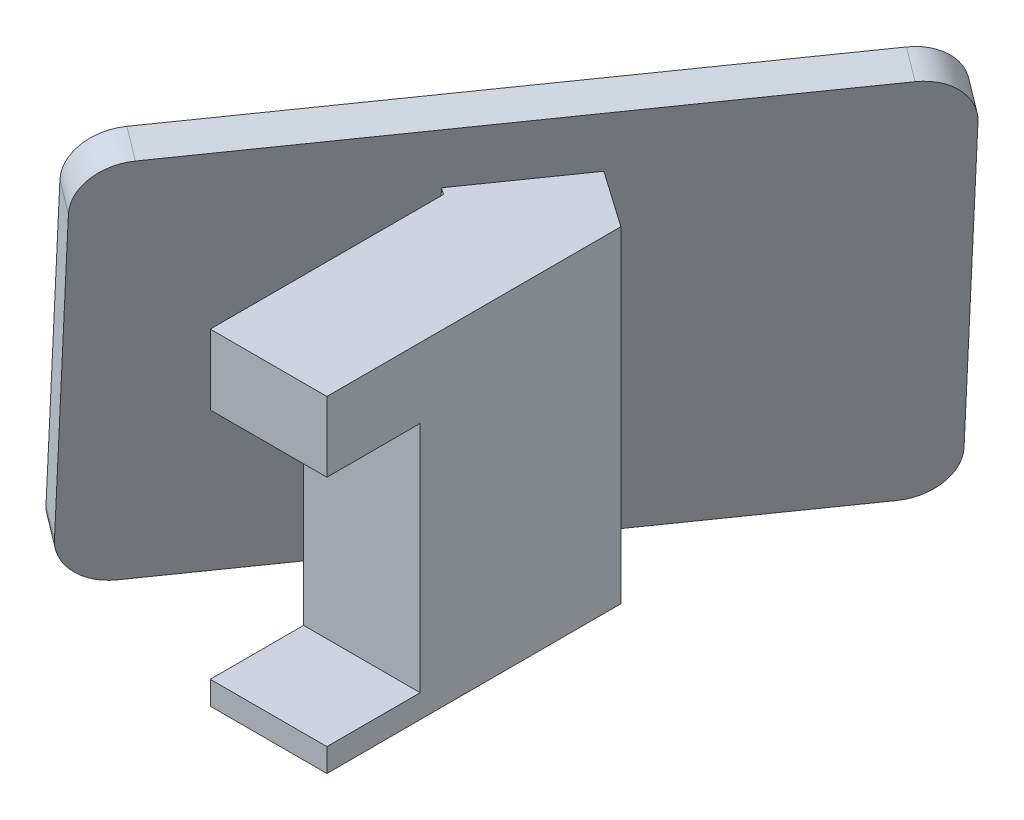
ISO-10303-21;
HEADER;
FILE_DESCRIPTION(('STEP AP214'),'2;1');
FILE_NAME('part.step','',(''),(''),'','','');
FILE_SCHEMA(('AUTOMOTIVE_DESIGN { 1 0 10303 214 1 1 1 1 }'));
ENDSEC;
DATA;
#1=APPLICATION_CONTEXT('core data for automotive mechanical design processes');
#2=APPLICATION_PROTOCOL_DEFINITION('international standard','automotive_design',2000,#1);
#3=PRODUCT_CONTEXT('',#1,'mechanical');
#4=PRODUCT('Part','Part','',(#3));
#5=PRODUCT_RELATED_PRODUCT_CATEGORY('part','',(#4));
#6=PRODUCT_DEFINITION_FORMATION('','',#4);
#7=PRODUCT_DEFINITION_CONTEXT('part definition',#1,'design');
#8=PRODUCT_DEFINITION('design','',#6,#7);
#9=PRODUCT_DEFINITION_SHAPE('','',#8);
#10=(LENGTH_UNIT() NAMED_UNIT(*) SI_UNIT(.MILLI.,.METRE.));
#11=(NAMED_UNIT(*) PLANE_ANGLE_UNIT() SI_UNIT($,.RADIAN.));
#12=(NAMED_UNIT(*) SI_UNIT($,.STERADIAN.) SOLID_ANGLE_UNIT());
#13=UNCERTAINTY_MEASURE_WITH_UNIT(LENGTH_MEASURE(1.E-05),#10,'distance_accuracy_value','');
#14=(GEOMETRIC_REPRESENTATION_CONTEXT(3) GLOBAL_UNCERTAINTY_ASSIGNED_CONTEXT((#13)) GLOBAL_UNIT_ASSIGNED_CONTEXT((#10,
#11,#12)) REPRESENTATION_CONTEXT('',''));
#15=CARTESIAN_POINT('',(0.,0.,0.));
#16=DIRECTION('',(0.,0.,1.));
#17=DIRECTION('',(1.,0.,0.));
#18=AXIS2_PLACEMENT_3D('',#15,#16,#17);
#19=CARTESIAN_POINT('',(25.,50.,0.));
#20=DIRECTION('',(0.,1.,0.));
#21=DIRECTION('',(0.,0.,1.));
#22=AXIS2_PLACEMENT_3D('',#19,#20,#21);
#23=PLANE('',#22);
#24=DIRECTION('',(0.,0.,-1.));
#25=VECTOR('',#24,1.);
#26=CARTESIAN_POINT('',(-25.,50.,0.));
#27=LINE('',#26,#25);
#28=CARTESIAN_POINT('',(-25.,50.,40.));
#29=VERTEX_POINT('',#28);
#30=CARTESIAN_POINT('',(-25.,50.,0.));
#31=VERTEX_POINT('',#30);
#32=EDGE_CURVE('E319',#29,#31,#27,.T.);
#33=ORIENTED_EDGE('',*,*,#32,.T.);
#34=DIRECTION('',(-1.,0.,0.));
#35=VECTOR('',#34,1.);
#36=CARTESIAN_POINT('',(25.,50.,0.));
#37=LINE('',#36,#35);
#38=CARTESIAN_POINT('',(25.,50.,0.));
#39=VERTEX_POINT('',#38);
#40=EDGE_CURVE('E369',#39,#31,#37,.T.);
#41=ORIENTED_EDGE('',*,*,#40,.F.);
#42=DIRECTION('',(0.,0.,-1.));
#43=VECTOR('',#42,1.);
#44=CARTESIAN_POINT('',(25.,50.,0.));
#45=LINE('',#44,#43);
#46=CARTESIAN_POINT('',(25.,50.,40.));
#47=VERTEX_POINT('',#46);
#48=EDGE_CURVE('E324',#47,#39,#45,.T.);
#49=ORIENTED_EDGE('',*,*,#48,.F.);
#50=DIRECTION('',(-1.,0.,0.));
#51=VECTOR('',#50,1.);
#52=CARTESIAN_POINT('',(25.,50.,40.));
#53=LINE('',#52,#51);
#54=EDGE_CURVE('E341',#47,#29,#53,.T.);
#55=ORIENTED_EDGE('',*,*,#54,.T.);
#56=EDGE_LOOP('',(#33,#41,#49,#55));
#57=FACE_BOUND('',#56,.T.);
#58=ADVANCED_FACE('F41',(#57),#23,.F.);
#59=CARTESIAN_POINT('',(25.,-50.,0.));
#60=DIRECTION('',(0.,0.,-1.));
#61=DIRECTION('',(-1.,0.,0.));
#62=AXIS2_PLACEMENT_3D('',#59,#60,#61);
#63=PLANE('',#62);
#64=DIRECTION('',(0.,-1.,0.));
#65=VECTOR('',#64,1.);
#66=CARTESIAN_POINT('',(-25.,-50.,0.));
#67=LINE('',#66,#65);
#68=CARTESIAN_POINT('',(-25.,-50.,0.));
#69=VERTEX_POINT('',#68);
#70=EDGE_CURVE('E344',#31,#69,#67,.T.);
#71=ORIENTED_EDGE('',*,*,#70,.T.);
#72=DIRECTION('',(-1.,0.,0.));
#73=VECTOR('',#72,1.);
#74=CARTESIAN_POINT('',(25.,-50.,0.));
#75=LINE('',#74,#73);
#76=CARTESIAN_POINT('',(25.,-50.,0.));
#77=VERTEX_POINT('',#76);
#78=EDGE_CURVE('E366',#77,#69,#75,.T.);
#79=ORIENTED_EDGE('',*,*,#78,.F.);
#80=DIRECTION('',(0.,-1.,0.));
#81=VECTOR('',#80,1.);
#82=CARTESIAN_POINT('',(25.,-50.,0.));
#83=LINE('',#82,#81);
#84=EDGE_CURVE('E327',#39,#77,#83,.T.);
#85=ORIENTED_EDGE('',*,*,#84,.F.);
#86=ORIENTED_EDGE('',*,*,#40,.T.);
#87=EDGE_LOOP('',(#71,#79,#85,#86));
#88=FACE_BOUND('',#87,.T.);
#89=ADVANCED_FACE('F459',(#88),#63,.F.);
#90=CARTESIAN_POINT('',(25.,-50.,40.));
#91=DIRECTION('',(0.,-1.,0.));
#92=DIRECTION('',(0.,0.,-1.));
#93=AXIS2_PLACEMENT_3D('',#90,#91,#92);
#94=PLANE('',#93);
#95=DIRECTION('',(0.,0.,1.));
#96=VECTOR('',#95,1.);
#97=CARTESIAN_POINT('',(-25.,-50.,40.));
#98=LINE('',#97,#96);
#99=CARTESIAN_POINT('',(-25.,-50.,40.));
#100=VERTEX_POINT('',#99);
#101=EDGE_CURVE('E346',#69,#100,#98,.T.);
#102=ORIENTED_EDGE('',*,*,#101,.T.);
#103=DIRECTION('',(-1.,0.,0.));
#104=VECTOR('',#103,1.);
#105=CARTESIAN_POINT('',(25.,-50.,40.));
#106=LINE('',#105,#104);
#107=CARTESIAN_POINT('',(25.,-50.,40.));
#108=VERTEX_POINT('',#107);
#109=EDGE_CURVE('E363',#108,#100,#106,.T.);
#110=ORIENTED_EDGE('',*,*,#109,.F.);
#111=DIRECTION('',(0.,0.,1.));
#112=VECTOR('',#111,1.);
#113=CARTESIAN_POINT('',(25.,-50.,40.));
#114=LINE('',#113,#112);
#115=EDGE_CURVE('E330',#77,#108,#114,.T.);
#116=ORIENTED_EDGE('',*,*,#115,.F.);
#117=ORIENTED_EDGE('',*,*,#78,.T.);
#118=EDGE_LOOP('',(#102,#110,#116,#117));
#119=FACE_BOUND('',#118,.T.);
#120=ADVANCED_FACE('F465',(#119),#94,.F.);
#121=CARTESIAN_POINT('',(25.,-60.,40.));
#122=DIRECTION('',(0.,0.,-1.));
#123=DIRECTION('',(0.,1.,0.));
#124=AXIS2_PLACEMENT_3D('',#121,#122,#123);
#125=PLANE('',#124);
#126=DIRECTION('',(0.,-1.,0.));
#127=VECTOR('',#126,1.);
#128=CARTESIAN_POINT('',(-25.,-60.,40.));
#129=LINE('',#128,#127);
#130=CARTESIAN_POINT('',(-25.,-60.,40.));
#131=VERTEX_POINT('',#130);
#132=EDGE_CURVE('E348',#100,#131,#129,.T.);
#133=ORIENTED_EDGE('',*,*,#132,.T.);
#134=DIRECTION('',(-1.,0.,0.));
#135=VECTOR('',#134,1.);
#136=CARTESIAN_POINT('',(25.,-60.,40.));
#137=LINE('',#136,#135);
#138=CARTESIAN_POINT('',(25.,-60.,40.));
#139=VERTEX_POINT('',#138);
#140=EDGE_CURVE('E360',#139,#131,#137,.T.);
#141=ORIENTED_EDGE('',*,*,#140,.F.);
#142=DIRECTION('',(0.,-1.,0.));
#143=VECTOR('',#142,1.);
#144=CARTESIAN_POINT('',(25.,-60.,40.));
#145=LINE('',#144,#143);
#146=EDGE_CURVE('E332',#108,#139,#145,.T.);
#147=ORIENTED_EDGE('',*,*,#146,.F.);
#148=ORIENTED_EDGE('',*,*,#109,.T.);
#149=EDGE_LOOP('',(#133,#141,#147,#148));
#150=FACE_BOUND('',#149,.T.);
#151=ADVANCED_FACE('F471',(#150),#125,.F.);
#152=CARTESIAN_POINT('',(25.,-60.,-10.));
#153=DIRECTION('',(0.,1.,0.));
#154=DIRECTION('',(0.,0.,1.));
#155=AXIS2_PLACEMENT_3D('',#152,#153,#154);
#156=PLANE('',#155);
#157=DIRECTION('',(-0.819152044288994,0.,-0.573576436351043));
#158=VECTOR('',#157,1.);
#159=CARTESIAN_POINT('',(-25.,-60.,-60.));
#160=LINE('',#159,#158);
#161=CARTESIAN_POINT('',(-25.,-60.,-60.));
#162=VERTEX_POINT('',#161);
#163=CARTESIAN_POINT('',(-48.1301752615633,-60.,-76.1959230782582));
#164=VERTEX_POINT('',#163);
#165=EDGE_CURVE('E309',#162,#164,#160,.T.);
#166=ORIENTED_EDGE('',*,*,#165,.T.);
#167=DIRECTION('',(-0.573576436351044,0.,0.819152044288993));
#168=VECTOR('',#167,1.);
#169=CARTESIAN_POINT('',(-48.1301752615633,-60.,-76.1959230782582));
#170=LINE('',#169,#168);
#171=CARTESIAN_POINT('',(-19.4513534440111,-59.9999999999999,-117.153525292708));
#172=VERTEX_POINT('',#171);
#173=EDGE_CURVE('E372',#164,#172,#170,.F.);
#174=ORIENTED_EDGE('',*,*,#173,.T.);
#175=DIRECTION('',(0.819152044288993,0.,0.573576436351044));
#176=VECTOR('',#175,1.);
#177=CARTESIAN_POINT('',(-20.8957395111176,-60.,-118.164895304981));
#178=LINE('',#177,#176);
#179=CARTESIAN_POINT('',(25.,-60.,-86.0283525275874));
#180=VERTEX_POINT('',#179);
#181=EDGE_CURVE('E298',#172,#180,#178,.T.);
#182=ORIENTED_EDGE('',*,*,#181,.T.);
#183=DIRECTION('',(0.,0.,-1.));
#184=VECTOR('',#183,1.);
#185=CARTESIAN_POINT('',(25.,-60.,-10.));
#186=LINE('',#185,#184);
#187=EDGE_CURVE('E334',#139,#180,#186,.T.);
#188=ORIENTED_EDGE('',*,*,#187,.F.);
#189=ORIENTED_EDGE('',*,*,#140,.T.);
#190=DIRECTION('',(0.,0.,-1.));
#191=VECTOR('',#190,1.);
#192=CARTESIAN_POINT('',(-25.,-60.,-10.));
#193=LINE('',#192,#191);
#194=EDGE_CURVE('E350',#131,#162,#193,.T.);
#195=ORIENTED_EDGE('',*,*,#194,.T.);
#196=EDGE_LOOP('',(#166,#174,#182,#188,#189,#195));
#197=FACE_BOUND('',#196,.T.);
#198=ADVANCED_FACE('F475',(#197),#156,.F.);
#199=CARTESIAN_POINT('',(25.,80.,40.));
#200=DIRECTION('',(0.,-1.,0.));
#201=DIRECTION('',(0.,0.,-1.));
#202=AXIS2_PLACEMENT_3D('',#199,#200,#201);
#203=PLANE('',#202);
#204=DIRECTION('',(0.819152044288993,0.,0.573576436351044));
#205=VECTOR('',#204,1.);
#206=CARTESIAN_POINT('',(-20.8957395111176,80.,-118.164895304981));
#207=LINE('',#206,#205);
#208=CARTESIAN_POINT('',(0.770051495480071,80.,-102.994345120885));
#209=VERTEX_POINT('',#208);
#210=CARTESIAN_POINT('',(25.,80.,-86.0283525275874));
#211=VERTEX_POINT('',#210);
#212=EDGE_CURVE('E316',#209,#211,#207,.T.);
#213=ORIENTED_EDGE('',*,*,#212,.F.);
#214=DIRECTION('',(-0.573576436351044,0.,0.819152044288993));
#215=VECTOR('',#214,1.);
#216=CARTESIAN_POINT('',(-58.4439049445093,80.,-18.4280512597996));
#217=LINE('',#216,#215);
#218=CARTESIAN_POINT('',(-27.9087703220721,80.,-62.0367429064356));
#219=VERTEX_POINT('',#218);
#220=EDGE_CURVE('E378',#209,#219,#217,.T.);
#221=ORIENTED_EDGE('',*,*,#220,.T.);
#222=DIRECTION('',(-0.819152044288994,0.,-0.573576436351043));
#223=VECTOR('',#222,1.);
#224=CARTESIAN_POINT('',(-25.,80.,-60.));
#225=LINE('',#224,#223);
#226=CARTESIAN_POINT('',(-25.,80.,-60.));
#227=VERTEX_POINT('',#226);
#228=EDGE_CURVE('E313',#227,#219,#225,.T.);
#229=ORIENTED_EDGE('',*,*,#228,.F.);
#230=DIRECTION('',(0.,0.,1.));
#231=VECTOR('',#230,1.);
#232=CARTESIAN_POINT('',(-25.,80.,40.));
#233=LINE('',#232,#231);
#234=CARTESIAN_POINT('',(-25.,80.,40.));
#235=VERTEX_POINT('',#234);
#236=EDGE_CURVE('E352',#227,#235,#233,.T.);
#237=ORIENTED_EDGE('',*,*,#236,.T.);
#238=DIRECTION('',(-1.,0.,0.));
#239=VECTOR('',#238,1.);
#240=CARTESIAN_POINT('',(25.,80.,40.));
#241=LINE('',#240,#239);
#242=CARTESIAN_POINT('',(25.,80.,40.));
#243=VERTEX_POINT('',#242);
#244=EDGE_CURVE('E357',#243,#235,#241,.T.);
#245=ORIENTED_EDGE('',*,*,#244,.F.);
#246=DIRECTION('',(0.,0.,1.));
#247=VECTOR('',#246,1.);
#248=CARTESIAN_POINT('',(25.,80.,40.));
#249=LINE('',#248,#247);
#250=EDGE_CURVE('E337',#211,#243,#249,.T.);
#251=ORIENTED_EDGE('',*,*,#250,.F.);
#252=EDGE_LOOP('',(#213,#221,#229,#237,#245,#251));
#253=FACE_BOUND('',#252,.T.);
#254=ADVANCED_FACE('F479',(#253),#203,.F.);
#255=CARTESIAN_POINT('',(25.,50.,40.));
#256=DIRECTION('',(0.,0.,-1.));
#257=DIRECTION('',(0.,1.,0.));
#258=AXIS2_PLACEMENT_3D('',#255,#256,#257);
#259=PLANE('',#258);
#260=DIRECTION('',(0.,-1.,0.));
#261=VECTOR('',#260,1.);
#262=CARTESIAN_POINT('',(-25.,50.,40.));
#263=LINE('',#262,#261);
#264=EDGE_CURVE('E328',#235,#29,#263,.T.);
#265=ORIENTED_EDGE('',*,*,#264,.T.);
#266=ORIENTED_EDGE('',*,*,#54,.F.);
#267=DIRECTION('',(0.,-1.,0.));
#268=VECTOR('',#267,1.);
#269=CARTESIAN_POINT('',(25.,50.,40.));
#270=LINE('',#269,#268);
#271=EDGE_CURVE('E339',#243,#47,#270,.T.);
#272=ORIENTED_EDGE('',*,*,#271,.F.);
#273=ORIENTED_EDGE('',*,*,#244,.T.);
#274=EDGE_LOOP('',(#265,#266,#272,#273));
#275=FACE_BOUND('',#274,.T.);
#276=ADVANCED_FACE('F483',(#275),#259,.F.);
#277=CARTESIAN_POINT('',(25.,0.,0.));
#278=DIRECTION('',(-1.,0.,0.));
#279=DIRECTION('',(0.,0.,1.));
#280=AXIS2_PLACEMENT_3D('',#277,#278,#279);
#281=PLANE('',#280);
#282=ORIENTED_EDGE('',*,*,#48,.T.);
#283=ORIENTED_EDGE('',*,*,#84,.T.);
#284=ORIENTED_EDGE('',*,*,#115,.T.);
#285=ORIENTED_EDGE('',*,*,#146,.T.);
#286=ORIENTED_EDGE('',*,*,#187,.T.);
#287=DIRECTION('',(0.,-1.,0.));
#288=VECTOR('',#287,1.);
#289=CARTESIAN_POINT('',(25.,211.381162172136,-86.0283525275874));
#290=LINE('',#289,#288);
#291=EDGE_CURVE('E317',#211,#180,#290,.T.);
#292=ORIENTED_EDGE('',*,*,#291,.F.);
#293=ORIENTED_EDGE('',*,*,#250,.T.);
#294=ORIENTED_EDGE('',*,*,#271,.T.);
#295=EDGE_LOOP('',(#282,#283,#284,#285,#286,#292,#293,#294));
#296=FACE_BOUND('',#295,.T.);
#297=ADVANCED_FACE('F487',(#296),#281,.F.);
#298=CARTESIAN_POINT('',(-25.,0.,0.));
#299=DIRECTION('',(-1.,0.,0.));
#300=DIRECTION('',(0.,0.,1.));
#301=AXIS2_PLACEMENT_3D('',#298,#299,#300);
#302=PLANE('',#301);
#303=ORIENTED_EDGE('',*,*,#32,.F.);
#304=ORIENTED_EDGE('',*,*,#264,.F.);
#305=ORIENTED_EDGE('',*,*,#236,.F.);
#306=DIRECTION('',(0.,-1.,0.));
#307=VECTOR('',#306,1.);
#308=CARTESIAN_POINT('',(-25.,211.381162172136,-60.));
#309=LINE('',#308,#307);
#310=EDGE_CURVE('E312',#227,#162,#309,.T.);
#311=ORIENTED_EDGE('',*,*,#310,.T.);
#312=ORIENTED_EDGE('',*,*,#194,.F.);
#313=ORIENTED_EDGE('',*,*,#132,.F.);
#314=ORIENTED_EDGE('',*,*,#101,.F.);
#315=ORIENTED_EDGE('',*,*,#70,.F.);
#316=EDGE_LOOP('',(#303,#304,#305,#311,#312,#313,#314,#315));
#317=FACE_BOUND('',#316,.T.);
#318=ADVANCED_FACE('F489',(#317),#302,.T.);
#319=CARTESIAN_POINT('',(-25.,211.381162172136,-60.));
#320=DIRECTION('',(0.573576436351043,0.,-0.819152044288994));
#321=DIRECTION('',(-0.819152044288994,0.,-0.573576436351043));
#322=AXIS2_PLACEMENT_3D('',#319,#320,#321);
#323=PLANE('',#322);
#324=ORIENTED_EDGE('',*,*,#228,.T.);
#325=DIRECTION('',(0.14224425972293,0.984807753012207,0.0996005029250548));
#326=VECTOR('',#325,1.);
#327=CARTESIAN_POINT('',(-49.5745613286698,-70.0000000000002,-77.2072930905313));
#328=LINE('',#327,#326);
#329=EDGE_CURVE('E381',#219,#164,#328,.F.);
#330=ORIENTED_EDGE('',*,*,#329,.T.);
#331=ORIENTED_EDGE('',*,*,#165,.F.);
#332=ORIENTED_EDGE('',*,*,#310,.F.);
#333=EDGE_LOOP('',(#324,#330,#331,#332));
#334=FACE_BOUND('',#333,.T.);
#335=ADVANCED_FACE('F492',(#334),#323,.F.);
#336=CARTESIAN_POINT('',(-20.8957395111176,211.381162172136,-118.164895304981));
#337=DIRECTION('',(-0.573576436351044,0.,0.819152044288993));
#338=DIRECTION('',(0.819152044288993,0.,0.573576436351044));
#339=AXIS2_PLACEMENT_3D('',#336,#337,#338);
#340=PLANE('',#339);
#341=ORIENTED_EDGE('',*,*,#181,.F.);
#342=DIRECTION('',(-0.14224425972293,-0.984807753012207,-0.099600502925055));
#343=VECTOR('',#342,1.);
#344=CARTESIAN_POINT('',(-20.8957395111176,-70.0000000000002,-118.164895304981));
#345=LINE('',#344,#343);
#346=EDGE_CURVE('E375',#172,#209,#345,.F.);
#347=ORIENTED_EDGE('',*,*,#346,.T.);
#348=ORIENTED_EDGE('',*,*,#212,.T.);
#349=ORIENTED_EDGE('',*,*,#291,.T.);
#350=EDGE_LOOP('',(#341,#347,#348,#349));
#351=FACE_BOUND('',#350,.T.);
#352=ADVANCED_FACE('F497',(#351),#340,.F.);
#353=CARTESIAN_POINT('',(-57.6378588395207,12.406865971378,-40.3584632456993));
#354=DIRECTION('',(0.806707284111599,-0.173648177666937,0.564862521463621));
#355=DIRECTION('',(0.573576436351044,0.,-0.819152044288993));
#356=AXIS2_PLACEMENT_3D('',#353,#354,#355);
#357=PLANE('',#356);
#358=DIRECTION('',(-0.573576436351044,0.,0.819152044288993));
#359=VECTOR('',#358,1.);
#360=CARTESIAN_POINT('',(44.683481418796,-72.6452017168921,-212.634908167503));
#361=LINE('',#360,#359);
#362=CARTESIAN_POINT('',(33.2119526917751,-72.6452017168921,-196.251867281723));
#363=VERTEX_POINT('',#362);
#364=CARTESIAN_POINT('',(-104.446392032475,-72.6452017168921,0.344623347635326));
#365=VERTEX_POINT('',#364);
#366=EDGE_CURVE('E290',#363,#365,#361,.T.);
#367=ORIENTED_EDGE('',*,*,#366,.F.);
#368=CARTESIAN_POINT('',(36.0568378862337,-52.949046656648,-194.259857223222));
#369=DIRECTION('',(0.806707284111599,-0.173648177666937,0.564862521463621));
#370=DIRECTION('',(0.573576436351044,0.,-0.819152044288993));
#371=AXIS2_PLACEMENT_3D('',#368,#369,#370);
#372=CIRCLE('',#371,20.);
#373=CARTESIAN_POINT('',(47.5283666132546,-52.949046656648,-210.642898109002));
#374=VERTEX_POINT('',#373);
#375=EDGE_CURVE('E395',#363,#374,#372,.T.);
#376=ORIENTED_EDGE('',*,*,#375,.T.);
#377=DIRECTION('',(-0.14224425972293,-0.984807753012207,-0.099600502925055));
#378=VECTOR('',#377,1.);
#379=CARTESIAN_POINT('',(44.683481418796,-72.6452017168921,-212.634908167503));
#380=LINE('',#379,#378);
#381=CARTESIAN_POINT('',(67.4425629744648,84.924038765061,-196.698827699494));
#382=VERTEX_POINT('',#381);
#383=EDGE_CURVE('E303',#382,#374,#380,.T.);
#384=ORIENTED_EDGE('',*,*,#383,.F.);
#385=CARTESIAN_POINT('',(55.9710342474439,84.924038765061,-180.315786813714));
#386=DIRECTION('',(0.806707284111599,-0.173648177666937,0.564862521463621));
#387=DIRECTION('',(0.573576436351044,0.,-0.819152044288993));
#388=AXIS2_PLACEMENT_3D('',#385,#386,#387);
#389=CIRCLE('',#388,20.);
#390=CARTESIAN_POINT('',(58.8159194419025,104.620193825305,-178.323776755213));
#391=VERTEX_POINT('',#390);
#392=EDGE_CURVE('E389',#382,#391,#389,.T.);
#393=ORIENTED_EDGE('',*,*,#392,.T.);
#394=DIRECTION('',(0.573576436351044,0.,-0.819152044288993));
#395=VECTOR('',#394,1.);
#396=CARTESIAN_POINT('',(70.2874481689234,104.620193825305,-194.706817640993));
#397=LINE('',#396,#395);
#398=CARTESIAN_POINT('',(-78.8424252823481,104.620193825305,18.2727138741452));
#399=VERTEX_POINT('',#398);
#400=EDGE_CURVE('E301',#399,#391,#397,.T.);
#401=ORIENTED_EDGE('',*,*,#400,.F.);
#402=CARTESIAN_POINT('',(-81.6873104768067,84.924038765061,16.2807038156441));
#403=DIRECTION('',(0.806707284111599,-0.173648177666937,0.564862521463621));
#404=DIRECTION('',(0.573576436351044,0.,-0.819152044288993));
#405=AXIS2_PLACEMENT_3D('',#402,#403,#404);
#406=CIRCLE('',#405,20.);
#407=CARTESIAN_POINT('',(-93.1588392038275,84.924038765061,32.6637447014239));
#408=VERTEX_POINT('',#407);
#409=EDGE_CURVE('E391',#399,#408,#406,.T.);
#410=ORIENTED_EDGE('',*,*,#409,.T.);
#411=DIRECTION('',(0.14224425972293,0.984807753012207,0.099600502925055));
#412=VECTOR('',#411,1.);
#413=CARTESIAN_POINT('',(-115.917920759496,-72.6452017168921,16.7276642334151));
#414=LINE('',#413,#412);
#415=CARTESIAN_POINT('',(-113.073035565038,-52.9490466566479,18.7196742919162));
#416=VERTEX_POINT('',#415);
#417=EDGE_CURVE('E274',#416,#408,#414,.T.);
#418=ORIENTED_EDGE('',*,*,#417,.F.);
#419=CARTESIAN_POINT('',(-101.601506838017,-52.9490466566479,2.33663340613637));
#420=DIRECTION('',(0.806707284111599,-0.173648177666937,0.564862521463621));
#421=DIRECTION('',(0.573576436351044,0.,-0.819152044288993));
#422=AXIS2_PLACEMENT_3D('',#419,#420,#421);
#423=CIRCLE('',#422,20.);
#424=EDGE_CURVE('E393',#416,#365,#423,.T.);
#425=ORIENTED_EDGE('',*,*,#424,.T.);
#426=EDGE_LOOP('',(#367,#376,#384,#393,#401,#410,#418,#425));
#427=FACE_BOUND('',#426,.T.);
#428=ORIENTED_EDGE('',*,*,#329,.F.);
#429=ORIENTED_EDGE('',*,*,#220,.F.);
#430=ORIENTED_EDGE('',*,*,#346,.F.);
#431=ORIENTED_EDGE('',*,*,#173,.F.);
#432=EDGE_LOOP('',(#428,#429,#430,#431));
#433=FACE_BOUND('',#432,.T.);
#434=ADVANCED_FACE('F424',(#427,#433),#357,.T.);
#435=CARTESIAN_POINT('',(-128.01853002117,-70.040479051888,8.25472641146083));
#436=DIRECTION('',(0.573576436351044,0.,-0.819152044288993));
#437=DIRECTION('',(-0.819152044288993,0.,-0.573576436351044));
#438=AXIS2_PLACEMENT_3D('',#435,#436,#437);
#439=PLANE('',#438);
#440=DIRECTION('',(0.14224425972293,0.984807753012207,0.099600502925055));
#441=VECTOR('',#440,1.);
#442=CARTESIAN_POINT('',(-128.01853002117,-70.040479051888,8.25472641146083));
#443=LINE('',#442,#441);
#444=CARTESIAN_POINT('',(-125.173644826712,-50.3443239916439,10.2467364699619));
#445=VERTEX_POINT('',#444);
#446=CARTESIAN_POINT('',(-105.259448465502,87.528761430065,24.1908068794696));
#447=VERTEX_POINT('',#446);
#448=EDGE_CURVE('E286',#445,#447,#443,.T.);
#449=ORIENTED_EDGE('',*,*,#448,.F.);
#450=DIRECTION('',(0.806707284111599,-0.173648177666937,0.564862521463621));
#451=VECTOR('',#450,1.);
#452=CARTESIAN_POINT('',(-125.173644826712,-50.3443239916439,10.2467364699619));
#453=LINE('',#452,#451);
#454=EDGE_CURVE('E412',#445,#416,#453,.T.);
#455=ORIENTED_EDGE('',*,*,#454,.T.);
#456=ORIENTED_EDGE('',*,*,#417,.T.);
#457=DIRECTION('',(0.806707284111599,-0.173648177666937,0.564862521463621));
#458=VECTOR('',#457,1.);
#459=CARTESIAN_POINT('',(-105.259448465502,87.5287614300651,24.1908068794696));
#460=LINE('',#459,#458);
#461=EDGE_CURVE('E410',#408,#447,#460,.F.);
#462=ORIENTED_EDGE('',*,*,#461,.T.);
#463=EDGE_LOOP('',(#449,#455,#456,#462));
#464=FACE_BOUND('',#463,.T.);
#465=ADVANCED_FACE('F418',(#464),#439,.F.);
#466=CARTESIAN_POINT('',(58.1868389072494,107.224916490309,-203.179755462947));
#467=DIRECTION('',(-0.14224425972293,-0.984807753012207,-0.0996005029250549));
#468=DIRECTION('',(0.989729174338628,-0.142955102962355,0.));
#469=AXIS2_PLACEMENT_3D('',#466,#467,#468);
#470=PLANE('',#469);
#471=DIRECTION('',(0.573576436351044,0.,-0.819152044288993));
#472=VECTOR('',#471,1.);
#473=CARTESIAN_POINT('',(58.1868389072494,107.224916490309,-203.179755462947));
#474=LINE('',#473,#472);
#475=CARTESIAN_POINT('',(-90.9430345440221,107.224916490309,9.7997760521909));
#476=VERTEX_POINT('',#475);
#477=CARTESIAN_POINT('',(46.7153101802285,107.224916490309,-186.796714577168));
#478=VERTEX_POINT('',#477);
#479=EDGE_CURVE('E289',#476,#478,#474,.T.);
#480=ORIENTED_EDGE('',*,*,#479,.F.);
#481=DIRECTION('',(0.806707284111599,-0.173648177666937,0.564862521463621));
#482=VECTOR('',#481,1.);
#483=CARTESIAN_POINT('',(-90.9430345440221,107.224916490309,9.79977605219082));
#484=LINE('',#483,#482);
#485=EDGE_CURVE('E11',#476,#399,#484,.T.);
#486=ORIENTED_EDGE('',*,*,#485,.T.);
#487=ORIENTED_EDGE('',*,*,#400,.T.);
#488=DIRECTION('',(0.806707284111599,-0.173648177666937,0.564862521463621));
#489=VECTOR('',#488,1.);
#490=CARTESIAN_POINT('',(46.7153101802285,107.224916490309,-186.796714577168));
#491=LINE('',#490,#489);
#492=EDGE_CURVE('E49',#391,#478,#491,.F.);
#493=ORIENTED_EDGE('',*,*,#492,.T.);
#494=EDGE_LOOP('',(#480,#486,#487,#493));
#495=FACE_BOUND('',#494,.T.);
#496=ADVANCED_FACE('F431',(#495),#470,.F.);
#497=CARTESIAN_POINT('',(32.582872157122,-70.040479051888,-221.107845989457));
#498=DIRECTION('',(-0.573576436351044,0.,0.819152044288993));
#499=DIRECTION('',(0.819152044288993,0.,0.573576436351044));
#500=AXIS2_PLACEMENT_3D('',#497,#498,#499);
#501=PLANE('',#500);
#502=ORIENTED_EDGE('',*,*,#383,.T.);
#503=DIRECTION('',(0.806707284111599,-0.173648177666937,0.564862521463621));
#504=VECTOR('',#503,1.);
#505=CARTESIAN_POINT('',(35.4277573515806,-50.3443239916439,-219.115835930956));
#506=LINE('',#505,#504);
#507=CARTESIAN_POINT('',(35.4277573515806,-50.3443239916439,-219.115835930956));
#508=VERTEX_POINT('',#507);
#509=EDGE_CURVE('E400',#374,#508,#506,.F.);
#510=ORIENTED_EDGE('',*,*,#509,.T.);
#511=DIRECTION('',(-0.14224425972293,-0.984807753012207,-0.099600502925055));
#512=VECTOR('',#511,1.);
#513=CARTESIAN_POINT('',(32.582872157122,-70.040479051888,-221.107845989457));
#514=LINE('',#513,#512);
#515=CARTESIAN_POINT('',(55.3419537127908,87.5287614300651,-205.171765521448));
#516=VERTEX_POINT('',#515);
#517=EDGE_CURVE('E292',#516,#508,#514,.T.);
#518=ORIENTED_EDGE('',*,*,#517,.F.);
#519=DIRECTION('',(0.806707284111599,-0.173648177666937,0.564862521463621));
#520=VECTOR('',#519,1.);
#521=CARTESIAN_POINT('',(55.3419537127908,87.5287614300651,-205.171765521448));
#522=LINE('',#521,#520);
#523=EDGE_CURVE('E397',#516,#382,#522,.T.);
#524=ORIENTED_EDGE('',*,*,#523,.T.);
#525=EDGE_LOOP('',(#502,#510,#518,#524));
#526=FACE_BOUND('',#525,.T.);
#527=ADVANCED_FACE('F440',(#526),#501,.F.);
#528=CARTESIAN_POINT('',(32.582872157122,-70.040479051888,-221.107845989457));
#529=DIRECTION('',(0.14224425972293,0.984807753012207,0.0996005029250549));
#530=DIRECTION('',(-0.989729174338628,0.142955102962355,0.));
#531=AXIS2_PLACEMENT_3D('',#528,#529,#530);
#532=PLANE('',#531);
#533=DIRECTION('',(-0.573576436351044,0.,0.819152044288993));
#534=VECTOR('',#533,1.);
#535=CARTESIAN_POINT('',(32.582872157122,-70.040479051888,-221.107845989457));
#536=LINE('',#535,#534);
#537=CARTESIAN_POINT('',(21.1113434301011,-70.040479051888,-204.724805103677));
#538=VERTEX_POINT('',#537);
#539=CARTESIAN_POINT('',(-116.547001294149,-70.040479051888,-8.128314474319));
#540=VERTEX_POINT('',#539);
#541=EDGE_CURVE('E295',#538,#540,#536,.T.);
#542=ORIENTED_EDGE('',*,*,#541,.F.);
#543=DIRECTION('',(0.806707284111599,-0.173648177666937,0.564862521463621));
#544=VECTOR('',#543,1.);
#545=CARTESIAN_POINT('',(21.1113434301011,-70.040479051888,-204.724805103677));
#546=LINE('',#545,#544);
#547=EDGE_CURVE('E386',#538,#363,#546,.T.);
#548=ORIENTED_EDGE('',*,*,#547,.T.);
#549=ORIENTED_EDGE('',*,*,#366,.T.);
#550=DIRECTION('',(0.806707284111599,-0.173648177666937,0.564862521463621));
#551=VECTOR('',#550,1.);
#552=CARTESIAN_POINT('',(-116.547001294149,-70.040479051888,-8.12831447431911));
#553=LINE('',#552,#551);
#554=EDGE_CURVE('E384',#365,#540,#553,.F.);
#555=ORIENTED_EDGE('',*,*,#554,.T.);
#556=EDGE_LOOP('',(#542,#548,#549,#555));
#557=FACE_BOUND('',#556,.T.);
#558=ADVANCED_FACE('F448',(#557),#532,.F.);
#559=CARTESIAN_POINT('',(-69.7384681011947,15.011588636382,-48.8314010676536));
#560=DIRECTION('',(0.806707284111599,-0.173648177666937,0.564862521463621));
#561=DIRECTION('',(0.573576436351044,0.,-0.819152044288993));
#562=AXIS2_PLACEMENT_3D('',#559,#560,#561);
#563=PLANE('',#562);
#564=DIRECTION('',(-0.14224425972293,-0.984807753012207,-0.0996005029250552));
#565=VECTOR('',#564,1.);
#566=CARTESIAN_POINT('',(52.4740715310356,87.5287614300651,-201.076005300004));
#567=LINE('',#566,#565);
#568=CARTESIAN_POINT('',(52.4740715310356,87.5287614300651,-201.076005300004));
#569=VERTEX_POINT('',#568);
#570=CARTESIAN_POINT('',(32.5598751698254,-50.3443239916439,-215.020075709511));
#571=VERTEX_POINT('',#570);
#572=EDGE_CURVE('E256',#569,#571,#567,.T.);
#573=ORIENTED_EDGE('',*,*,#572,.F.);
#574=CARTESIAN_POINT('',(43.87042498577,87.5287614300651,-188.788724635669));
#575=DIRECTION('',(-0.806707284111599,0.173648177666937,-0.564862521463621));
#576=DIRECTION('',(-0.573576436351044,0.,0.819152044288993));
#577=AXIS2_PLACEMENT_3D('',#574,#575,#576);
#578=CIRCLE('',#577,15.);
#579=CARTESIAN_POINT('',(46.0040888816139,102.300877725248,-187.294717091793));
#580=VERTEX_POINT('',#579);
#581=EDGE_CURVE('E56',#580,#569,#578,.T.);
#582=ORIENTED_EDGE('',*,*,#581,.F.);
#583=DIRECTION('',(0.573576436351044,0.,-0.819152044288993));
#584=VECTOR('',#583,1.);
#585=CARTESIAN_POINT('',(-91.6542558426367,102.300877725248,9.30177353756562));
#586=LINE('',#585,#584);
#587=CARTESIAN_POINT('',(-91.6542558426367,102.300877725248,9.30177353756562));
#588=VERTEX_POINT('',#587);
#589=EDGE_CURVE('E236',#588,#580,#586,.T.);
#590=ORIENTED_EDGE('',*,*,#589,.F.);
#591=CARTESIAN_POINT('',(-93.7879197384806,87.528761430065,7.80776599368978));
#592=DIRECTION('',(-0.806707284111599,0.173648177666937,-0.564862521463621));
#593=DIRECTION('',(-0.573576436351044,0.,0.819152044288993));
#594=AXIS2_PLACEMENT_3D('',#591,#592,#593);
#595=CIRCLE('',#594,15.);
#596=CARTESIAN_POINT('',(-102.391566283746,87.528761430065,20.0950466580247));
#597=VERTEX_POINT('',#596);
#598=EDGE_CURVE('E239',#597,#588,#595,.T.);
#599=ORIENTED_EDGE('',*,*,#598,.F.);
#600=DIRECTION('',(0.14224425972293,0.984807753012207,0.0996005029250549));
#601=VECTOR('',#600,1.);
#602=CARTESIAN_POINT('',(-122.305762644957,-50.3443239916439,6.15097624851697));
#603=LINE('',#602,#601);
#604=CARTESIAN_POINT('',(-122.305762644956,-50.3443239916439,6.15097624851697));
#605=VERTEX_POINT('',#604);
#606=EDGE_CURVE('E267',#605,#597,#603,.T.);
#607=ORIENTED_EDGE('',*,*,#606,.F.);
#608=CARTESIAN_POINT('',(-113.702116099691,-50.3443239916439,-6.13630441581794));
#609=DIRECTION('',(-0.806707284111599,0.173648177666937,-0.564862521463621));
#610=DIRECTION('',(-0.573576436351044,0.,0.819152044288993));
#611=AXIS2_PLACEMENT_3D('',#608,#609,#610);
#612=CIRCLE('',#611,15.);
#613=CARTESIAN_POINT('',(-115.835779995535,-65.116440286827,-7.63031195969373));
#614=VERTEX_POINT('',#613);
#615=EDGE_CURVE('E264',#614,#605,#612,.T.);
#616=ORIENTED_EDGE('',*,*,#615,.F.);
#617=DIRECTION('',(-0.573576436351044,0.,0.819152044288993));
#618=VECTOR('',#617,1.);
#619=CARTESIAN_POINT('',(21.8225647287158,-65.116440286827,-204.226802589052));
#620=LINE('',#619,#618);
#621=CARTESIAN_POINT('',(21.8225647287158,-65.116440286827,-204.226802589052));
#622=VERTEX_POINT('',#621);
#623=EDGE_CURVE('E261',#622,#614,#620,.T.);
#624=ORIENTED_EDGE('',*,*,#623,.F.);
#625=CARTESIAN_POINT('',(23.9562286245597,-50.3443239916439,-202.732795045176));
#626=DIRECTION('',(-0.806707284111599,0.173648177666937,-0.564862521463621));
#627=DIRECTION('',(-0.573576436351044,0.,0.819152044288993));
#628=AXIS2_PLACEMENT_3D('',#625,#626,#627);
#629=CIRCLE('',#628,15.);
#630=EDGE_CURVE('E258',#571,#622,#629,.T.);
#631=ORIENTED_EDGE('',*,*,#630,.F.);
#632=EDGE_LOOP('',(#573,#582,#590,#599,#607,#616,#624,#631));
#633=FACE_BOUND('',#632,.T.);
#634=ORIENTED_EDGE('',*,*,#517,.T.);
#635=CARTESIAN_POINT('',(23.9562286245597,-50.3443239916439,-202.732795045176));
#636=DIRECTION('',(0.806707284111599,-0.173648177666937,0.564862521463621));
#637=DIRECTION('',(0.573576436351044,0.,-0.819152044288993));
#638=AXIS2_PLACEMENT_3D('',#635,#636,#637);
#639=CIRCLE('',#638,20.);
#640=EDGE_CURVE('E408',#508,#538,#639,.F.);
#641=ORIENTED_EDGE('',*,*,#640,.T.);
#642=ORIENTED_EDGE('',*,*,#541,.T.);
#643=CARTESIAN_POINT('',(-113.702116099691,-50.3443239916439,-6.13630441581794));
#644=DIRECTION('',(0.806707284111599,-0.173648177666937,0.564862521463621));
#645=DIRECTION('',(0.573576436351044,0.,-0.819152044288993));
#646=AXIS2_PLACEMENT_3D('',#643,#644,#645);
#647=CIRCLE('',#646,20.);
#648=EDGE_CURVE('E406',#540,#445,#647,.F.);
#649=ORIENTED_EDGE('',*,*,#648,.T.);
#650=ORIENTED_EDGE('',*,*,#448,.T.);
#651=CARTESIAN_POINT('',(-93.7879197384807,87.528761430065,7.80776599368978));
#652=DIRECTION('',(0.806707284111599,-0.173648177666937,0.564862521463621));
#653=DIRECTION('',(0.573576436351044,0.,-0.819152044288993));
#654=AXIS2_PLACEMENT_3D('',#651,#652,#653);
#655=CIRCLE('',#654,20.);
#656=EDGE_CURVE('E404',#447,#476,#655,.F.);
#657=ORIENTED_EDGE('',*,*,#656,.T.);
#658=ORIENTED_EDGE('',*,*,#479,.T.);
#659=CARTESIAN_POINT('',(43.8704249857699,87.5287614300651,-188.788724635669));
#660=DIRECTION('',(0.806707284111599,-0.173648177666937,0.564862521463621));
#661=DIRECTION('',(0.573576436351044,0.,-0.819152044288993));
#662=AXIS2_PLACEMENT_3D('',#659,#660,#661);
#663=CIRCLE('',#662,20.);
#664=EDGE_CURVE('E402',#478,#516,#663,.F.);
#665=ORIENTED_EDGE('',*,*,#664,.T.);
#666=EDGE_LOOP('',(#634,#641,#642,#649,#650,#657,#658,#665));
#667=FACE_BOUND('',#666,.T.);
#668=ADVANCED_FACE('F434',(#633,#667),#563,.F.);
#669=CARTESIAN_POINT('',(23.9562286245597,-50.3443239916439,-202.732795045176));
#670=DIRECTION('',(0.806707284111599,-0.173648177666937,0.564862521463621));
#671=DIRECTION('',(0.573576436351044,0.,-0.819152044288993));
#672=AXIS2_PLACEMENT_3D('',#669,#670,#671);
#673=CYLINDRICAL_SURFACE('',#672,20.);
#674=ORIENTED_EDGE('',*,*,#640,.F.);
#675=ORIENTED_EDGE('',*,*,#509,.F.);
#676=ORIENTED_EDGE('',*,*,#375,.F.);
#677=ORIENTED_EDGE('',*,*,#547,.F.);
#678=EDGE_LOOP('',(#674,#675,#676,#677));
#679=FACE_BOUND('',#678,.T.);
#680=ADVANCED_FACE('F445',(#679),#673,.T.);
#681=CARTESIAN_POINT('',(-113.702116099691,-50.3443239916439,-6.13630441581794));
#682=DIRECTION('',(0.806707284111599,-0.173648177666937,0.564862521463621));
#683=DIRECTION('',(0.573576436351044,0.,-0.819152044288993));
#684=AXIS2_PLACEMENT_3D('',#681,#682,#683);
#685=CYLINDRICAL_SURFACE('',#684,20.);
#686=ORIENTED_EDGE('',*,*,#648,.F.);
#687=ORIENTED_EDGE('',*,*,#554,.F.);
#688=ORIENTED_EDGE('',*,*,#424,.F.);
#689=ORIENTED_EDGE('',*,*,#454,.F.);
#690=EDGE_LOOP('',(#686,#687,#688,#689));
#691=FACE_BOUND('',#690,.T.);
#692=ADVANCED_FACE('F450',(#691),#685,.T.);
#693=CARTESIAN_POINT('',(-93.7879197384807,87.528761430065,7.80776599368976));
#694=DIRECTION('',(0.806707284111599,-0.173648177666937,0.564862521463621));
#695=DIRECTION('',(0.573576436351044,0.,-0.819152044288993));
#696=AXIS2_PLACEMENT_3D('',#693,#694,#695);
#697=CYLINDRICAL_SURFACE('',#696,20.);
#698=ORIENTED_EDGE('',*,*,#656,.F.);
#699=ORIENTED_EDGE('',*,*,#461,.F.);
#700=ORIENTED_EDGE('',*,*,#409,.F.);
#701=ORIENTED_EDGE('',*,*,#485,.F.);
#702=EDGE_LOOP('',(#698,#699,#700,#701));
#703=FACE_BOUND('',#702,.T.);
#704=ADVANCED_FACE('F430',(#703),#697,.T.);
#705=CARTESIAN_POINT('',(43.8704249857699,87.5287614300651,-188.788724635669));
#706=DIRECTION('',(0.806707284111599,-0.173648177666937,0.564862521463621));
#707=DIRECTION('',(0.573576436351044,0.,-0.819152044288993));
#708=AXIS2_PLACEMENT_3D('',#705,#706,#707);
#709=CYLINDRICAL_SURFACE('',#708,20.);
#710=ORIENTED_EDGE('',*,*,#664,.F.);
#711=ORIENTED_EDGE('',*,*,#492,.F.);
#712=ORIENTED_EDGE('',*,*,#392,.F.);
#713=ORIENTED_EDGE('',*,*,#523,.F.);
#714=EDGE_LOOP('',(#710,#711,#712,#713));
#715=FACE_BOUND('',#714,.T.);
#716=ADVANCED_FACE('F43',(#715),#709,.T.);
#717=CARTESIAN_POINT('',(44.6771322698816,87.3551132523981,-188.223862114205));
#718=DIRECTION('',(-0.806707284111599,0.173648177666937,-0.564862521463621));
#719=DIRECTION('',(-0.573576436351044,0.,0.819152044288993));
#720=AXIS2_PLACEMENT_3D('',#717,#718,#719);
#721=CYLINDRICAL_SURFACE('',#720,15.);
#722=ORIENTED_EDGE('',*,*,#581,.T.);
#723=DIRECTION('',(-0.806707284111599,0.173648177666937,-0.564862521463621));
#724=VECTOR('',#723,1.);
#725=CARTESIAN_POINT('',(53.2807788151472,87.3551132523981,-200.51114277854));
#726=LINE('',#725,#724);
#727=CARTESIAN_POINT('',(53.2807788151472,87.3551132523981,-200.51114277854));
#728=VERTEX_POINT('',#727);
#729=EDGE_CURVE('E213',#728,#569,#726,.T.);
#730=ORIENTED_EDGE('',*,*,#729,.F.);
#731=CARTESIAN_POINT('',(44.6771322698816,87.3551132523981,-188.223862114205));
#732=DIRECTION('',(-0.806707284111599,0.173648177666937,-0.564862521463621));
#733=DIRECTION('',(-0.573576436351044,0.,0.819152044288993));
#734=AXIS2_PLACEMENT_3D('',#731,#732,#733);
#735=CIRCLE('',#734,15.);
#736=CARTESIAN_POINT('',(46.8107961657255,102.127229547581,-186.729854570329));
#737=VERTEX_POINT('',#736);
#738=EDGE_CURVE('E217',#737,#728,#735,.T.);
#739=ORIENTED_EDGE('',*,*,#738,.F.);
#740=DIRECTION('',(-0.806707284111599,0.173648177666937,-0.564862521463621));
#741=VECTOR('',#740,1.);
#742=CARTESIAN_POINT('',(46.8107961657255,102.127229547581,-186.729854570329));
#743=LINE('',#742,#741);
#744=EDGE_CURVE('E272',#737,#580,#743,.T.);
#745=ORIENTED_EDGE('',*,*,#744,.T.);
#746=EDGE_LOOP('',(#722,#730,#739,#745));
#747=FACE_BOUND('',#746,.T.);
#748=ADVANCED_FACE('F215',(#747),#721,.F.);
#749=CARTESIAN_POINT('',(-90.8475485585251,102.127229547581,9.86663605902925));
#750=DIRECTION('',(0.14224425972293,0.984807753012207,0.099600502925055));
#751=DIRECTION('',(-0.989729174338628,0.142955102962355,0.));
#752=AXIS2_PLACEMENT_3D('',#749,#750,#751);
#753=PLANE('',#752);
#754=ORIENTED_EDGE('',*,*,#589,.T.);
#755=ORIENTED_EDGE('',*,*,#744,.F.);
#756=DIRECTION('',(0.573576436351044,0.,-0.819152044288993));
#757=VECTOR('',#756,1.);
#758=CARTESIAN_POINT('',(-90.8475485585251,102.127229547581,9.86663605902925));
#759=LINE('',#758,#757);
#760=CARTESIAN_POINT('',(-90.8475485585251,102.127229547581,9.86663605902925));
#761=VERTEX_POINT('',#760);
#762=EDGE_CURVE('E223',#761,#737,#759,.T.);
#763=ORIENTED_EDGE('',*,*,#762,.F.);
#764=DIRECTION('',(-0.806707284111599,0.173648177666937,-0.564862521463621));
#765=VECTOR('',#764,1.);
#766=CARTESIAN_POINT('',(-90.8475485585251,102.127229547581,9.86663605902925));
#767=LINE('',#766,#765);
#768=EDGE_CURVE('E275',#761,#588,#767,.T.);
#769=ORIENTED_EDGE('',*,*,#768,.T.);
#770=EDGE_LOOP('',(#754,#755,#763,#769));
#771=FACE_BOUND('',#770,.T.);
#772=ADVANCED_FACE('F519',(#771),#753,.F.);
#773=CARTESIAN_POINT('',(-92.981212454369,87.3551132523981,8.3726285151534));
#774=DIRECTION('',(-0.806707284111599,0.173648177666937,-0.564862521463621));
#775=DIRECTION('',(-0.573576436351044,0.,0.819152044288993));
#776=AXIS2_PLACEMENT_3D('',#773,#774,#775);
#777=CYLINDRICAL_SURFACE('',#776,15.);
#778=ORIENTED_EDGE('',*,*,#598,.T.);
#779=ORIENTED_EDGE('',*,*,#768,.F.);
#780=CARTESIAN_POINT('',(-92.981212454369,87.3551132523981,8.3726285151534));
#781=DIRECTION('',(-0.806707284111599,0.173648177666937,-0.564862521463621));
#782=DIRECTION('',(-0.573576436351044,0.,0.819152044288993));
#783=AXIS2_PLACEMENT_3D('',#780,#781,#782);
#784=CIRCLE('',#783,15.);
#785=CARTESIAN_POINT('',(-101.584858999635,87.3551132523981,20.6599091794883));
#786=VERTEX_POINT('',#785);
#787=EDGE_CURVE('E252',#786,#761,#784,.T.);
#788=ORIENTED_EDGE('',*,*,#787,.F.);
#789=DIRECTION('',(-0.806707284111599,0.173648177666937,-0.564862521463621));
#790=VECTOR('',#789,1.);
#791=CARTESIAN_POINT('',(-101.584858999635,87.3551132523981,20.6599091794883));
#792=LINE('',#791,#790);
#793=EDGE_CURVE('E277',#786,#597,#792,.T.);
#794=ORIENTED_EDGE('',*,*,#793,.T.);
#795=EDGE_LOOP('',(#778,#779,#788,#794));
#796=FACE_BOUND('',#795,.T.);
#797=ADVANCED_FACE('F537',(#796),#777,.F.);
#798=CARTESIAN_POINT('',(-121.499055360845,-50.5179721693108,6.71583876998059));
#799=DIRECTION('',(-0.573576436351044,0.,0.819152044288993));
#800=DIRECTION('',(0.819152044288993,0.,0.573576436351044));
#801=AXIS2_PLACEMENT_3D('',#798,#799,#800);
#802=PLANE('',#801);
#803=ORIENTED_EDGE('',*,*,#606,.T.);
#804=ORIENTED_EDGE('',*,*,#793,.F.);
#805=DIRECTION('',(0.14224425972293,0.984807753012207,0.0996005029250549));
#806=VECTOR('',#805,1.);
#807=CARTESIAN_POINT('',(-121.499055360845,-50.5179721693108,6.71583876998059));
#808=LINE('',#807,#806);
#809=CARTESIAN_POINT('',(-121.499055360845,-50.5179721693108,6.71583876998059));
#810=VERTEX_POINT('',#809);
#811=EDGE_CURVE('E249',#810,#786,#808,.T.);
#812=ORIENTED_EDGE('',*,*,#811,.F.);
#813=DIRECTION('',(-0.806707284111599,0.173648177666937,-0.564862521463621));
#814=VECTOR('',#813,1.);
#815=CARTESIAN_POINT('',(-121.499055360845,-50.5179721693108,6.71583876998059));
#816=LINE('',#815,#814);
#817=EDGE_CURVE('E279',#810,#605,#816,.T.);
#818=ORIENTED_EDGE('',*,*,#817,.T.);
#819=EDGE_LOOP('',(#803,#804,#812,#818));
#820=FACE_BOUND('',#819,.T.);
#821=ADVANCED_FACE('F533',(#820),#802,.F.);
#822=CARTESIAN_POINT('',(-112.895408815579,-50.5179721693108,-5.57144189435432));
#823=DIRECTION('',(-0.806707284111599,0.173648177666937,-0.564862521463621));
#824=DIRECTION('',(-0.573576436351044,0.,0.819152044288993));
#825=AXIS2_PLACEMENT_3D('',#822,#823,#824);
#826=CYLINDRICAL_SURFACE('',#825,15.);
#827=ORIENTED_EDGE('',*,*,#615,.T.);
#828=ORIENTED_EDGE('',*,*,#817,.F.);
#829=CARTESIAN_POINT('',(-112.895408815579,-50.5179721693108,-5.57144189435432));
#830=DIRECTION('',(-0.806707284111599,0.173648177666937,-0.564862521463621));
#831=DIRECTION('',(-0.573576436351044,0.,0.819152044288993));
#832=AXIS2_PLACEMENT_3D('',#829,#830,#831);
#833=CIRCLE('',#832,15.);
#834=CARTESIAN_POINT('',(-115.029072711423,-65.2900884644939,-7.06544943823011));
#835=VERTEX_POINT('',#834);
#836=EDGE_CURVE('E246',#835,#810,#833,.T.);
#837=ORIENTED_EDGE('',*,*,#836,.F.);
#838=DIRECTION('',(-0.806707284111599,0.173648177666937,-0.564862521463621));
#839=VECTOR('',#838,1.);
#840=CARTESIAN_POINT('',(-115.029072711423,-65.2900884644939,-7.06544943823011));
#841=LINE('',#840,#839);
#842=EDGE_CURVE('E281',#835,#614,#841,.T.);
#843=ORIENTED_EDGE('',*,*,#842,.T.);
#844=EDGE_LOOP('',(#827,#828,#837,#843));
#845=FACE_BOUND('',#844,.T.);
#846=ADVANCED_FACE('F529',(#845),#826,.F.);
#847=CARTESIAN_POINT('',(22.6292720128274,-65.2900884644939,-203.661940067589));
#848=DIRECTION('',(-0.14224425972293,-0.984807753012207,-0.0996005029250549));
#849=DIRECTION('',(0.989729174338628,-0.142955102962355,0.));
#850=AXIS2_PLACEMENT_3D('',#847,#848,#849);
#851=PLANE('',#850);
#852=ORIENTED_EDGE('',*,*,#623,.T.);
#853=ORIENTED_EDGE('',*,*,#842,.F.);
#854=DIRECTION('',(-0.573576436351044,0.,0.819152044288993));
#855=VECTOR('',#854,1.);
#856=CARTESIAN_POINT('',(22.6292720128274,-65.2900884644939,-203.661940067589));
#857=LINE('',#856,#855);
#858=CARTESIAN_POINT('',(22.6292720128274,-65.2900884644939,-203.661940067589));
#859=VERTEX_POINT('',#858);
#860=EDGE_CURVE('E243',#859,#835,#857,.T.);
#861=ORIENTED_EDGE('',*,*,#860,.F.);
#862=DIRECTION('',(-0.806707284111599,0.173648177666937,-0.564862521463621));
#863=VECTOR('',#862,1.);
#864=CARTESIAN_POINT('',(22.6292720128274,-65.2900884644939,-203.661940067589));
#865=LINE('',#864,#863);
#866=EDGE_CURVE('E283',#859,#622,#865,.T.);
#867=ORIENTED_EDGE('',*,*,#866,.T.);
#868=EDGE_LOOP('',(#852,#853,#861,#867));
#869=FACE_BOUND('',#868,.T.);
#870=ADVANCED_FACE('F525',(#869),#851,.F.);
#871=CARTESIAN_POINT('',(24.7629359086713,-50.5179721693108,-202.167932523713));
#872=DIRECTION('',(-0.806707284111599,0.173648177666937,-0.564862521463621));
#873=DIRECTION('',(-0.573576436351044,0.,0.819152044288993));
#874=AXIS2_PLACEMENT_3D('',#871,#872,#873);
#875=CYLINDRICAL_SURFACE('',#874,15.);
#876=ORIENTED_EDGE('',*,*,#630,.T.);
#877=ORIENTED_EDGE('',*,*,#866,.F.);
#878=CARTESIAN_POINT('',(24.7629359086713,-50.5179721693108,-202.167932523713));
#879=DIRECTION('',(-0.806707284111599,0.173648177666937,-0.564862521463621));
#880=DIRECTION('',(-0.573576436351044,0.,0.819152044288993));
#881=AXIS2_PLACEMENT_3D('',#878,#879,#880);
#882=CIRCLE('',#881,15.);
#883=CARTESIAN_POINT('',(33.366582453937,-50.5179721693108,-214.455213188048));
#884=VERTEX_POINT('',#883);
#885=EDGE_CURVE('E231',#884,#859,#882,.T.);
#886=ORIENTED_EDGE('',*,*,#885,.F.);
#887=DIRECTION('',(-0.806707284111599,0.173648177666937,-0.564862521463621));
#888=VECTOR('',#887,1.);
#889=CARTESIAN_POINT('',(33.366582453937,-50.5179721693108,-214.455213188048));
#890=LINE('',#889,#888);
#891=EDGE_CURVE('E222',#884,#571,#890,.T.);
#892=ORIENTED_EDGE('',*,*,#891,.T.);
#893=EDGE_LOOP('',(#876,#877,#886,#892));
#894=FACE_BOUND('',#893,.T.);
#895=ADVANCED_FACE('F522',(#894),#875,.F.);
#896=CARTESIAN_POINT('',(53.2807788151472,87.3551132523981,-200.51114277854));
#897=DIRECTION('',(0.573576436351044,0.,-0.819152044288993));
#898=DIRECTION('',(-0.819152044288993,0.,-0.573576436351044));
#899=AXIS2_PLACEMENT_3D('',#896,#897,#898);
#900=PLANE('',#899);
#901=ORIENTED_EDGE('',*,*,#572,.T.);
#902=ORIENTED_EDGE('',*,*,#891,.F.);
#903=DIRECTION('',(-0.14224425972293,-0.984807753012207,-0.0996005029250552));
#904=VECTOR('',#903,1.);
#905=CARTESIAN_POINT('',(53.2807788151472,87.3551132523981,-200.51114277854));
#906=LINE('',#905,#904);
#907=EDGE_CURVE('E226',#728,#884,#906,.T.);
#908=ORIENTED_EDGE('',*,*,#907,.F.);
#909=ORIENTED_EDGE('',*,*,#729,.T.);
#910=EDGE_LOOP('',(#901,#902,#908,#909));
#911=FACE_BOUND('',#910,.T.);
#912=ADVANCED_FACE('F227',(#911),#900,.F.);
#913=CARTESIAN_POINT('',(44.6771322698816,87.3551132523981,-188.223862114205));
#914=DIRECTION('',(-0.806707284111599,0.173648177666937,-0.564862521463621));
#915=DIRECTION('',(-0.573576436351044,0.,0.819152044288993));
#916=AXIS2_PLACEMENT_3D('',#913,#914,#915);
#917=PLANE('',#916);
#918=ORIENTED_EDGE('',*,*,#738,.T.);
#919=ORIENTED_EDGE('',*,*,#907,.T.);
#920=ORIENTED_EDGE('',*,*,#885,.T.);
#921=ORIENTED_EDGE('',*,*,#860,.T.);
#922=ORIENTED_EDGE('',*,*,#836,.T.);
#923=ORIENTED_EDGE('',*,*,#811,.T.);
#924=ORIENTED_EDGE('',*,*,#787,.T.);
#925=ORIENTED_EDGE('',*,*,#762,.T.);
#926=EDGE_LOOP('',(#918,#919,#920,#921,#922,#923,#924,#925));
#927=FACE_BOUND('',#926,.T.);
#928=ADVANCED_FACE('F233',(#927),#917,.T.);
#929=CLOSED_SHELL('',(#58,#89,#120,#151,#198,#254,#276,#297,#318,#335,#352,#434,#465,#496,#527,
#558,#668,#680,#692,#704,#716,#748,#772,#797,#821,#846,#870,#895,#912,#928));
#930=MANIFOLD_SOLID_BREP('B2',#929);
#931=ADVANCED_BREP_SHAPE_REPRESENTATION('',(#18,#930),#14);
#932=SHAPE_DEFINITION_REPRESENTATION(#9,#931);
ENDSEC;
END-ISO-10303-21;
